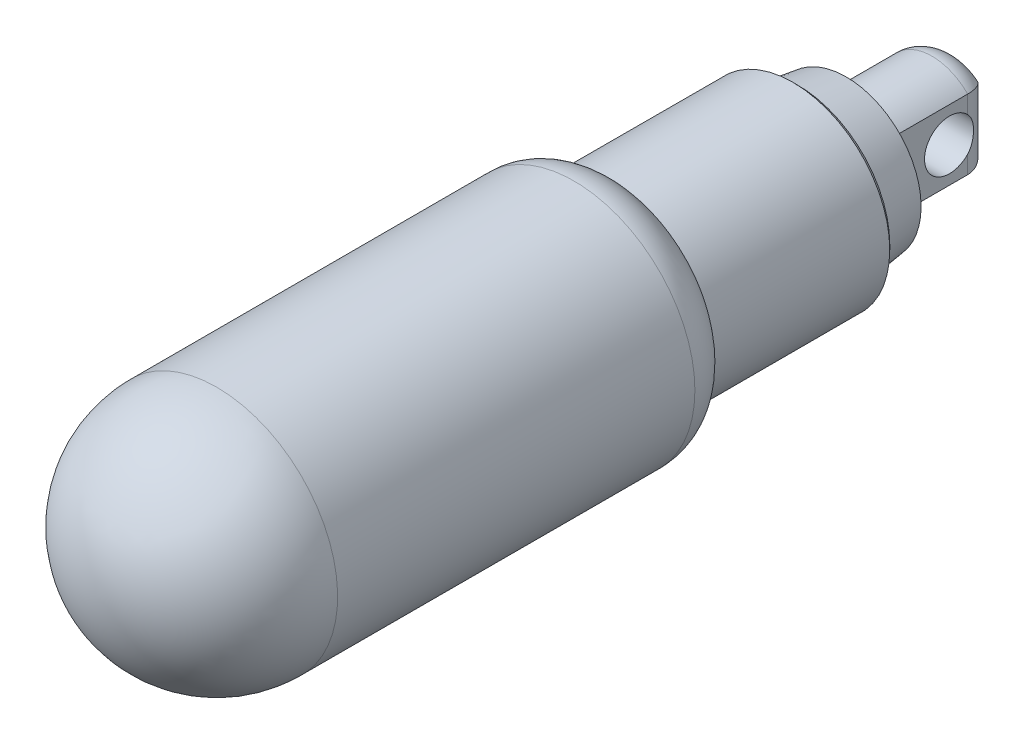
ISO-10303-21;
HEADER;
FILE_DESCRIPTION(('STEP AP214'),'2;1');
FILE_NAME('part.step','',(''),(''),'','','');
FILE_SCHEMA(('AUTOMOTIVE_DESIGN { 1 0 10303 214 1 1 1 1 }'));
ENDSEC;
DATA;
#1=APPLICATION_CONTEXT('core data for automotive mechanical design processes');
#2=APPLICATION_PROTOCOL_DEFINITION('international standard','automotive_design',2000,#1);
#3=PRODUCT_CONTEXT('',#1,'mechanical');
#4=PRODUCT('Part','Part','',(#3));
#5=PRODUCT_RELATED_PRODUCT_CATEGORY('part','',(#4));
#6=PRODUCT_DEFINITION_FORMATION('','',#4);
#7=PRODUCT_DEFINITION_CONTEXT('part definition',#1,'design');
#8=PRODUCT_DEFINITION('design','',#6,#7);
#9=PRODUCT_DEFINITION_SHAPE('','',#8);
#10=(LENGTH_UNIT() NAMED_UNIT(*) SI_UNIT(.MILLI.,.METRE.));
#11=(NAMED_UNIT(*) PLANE_ANGLE_UNIT() SI_UNIT($,.RADIAN.));
#12=(NAMED_UNIT(*) SI_UNIT($,.STERADIAN.) SOLID_ANGLE_UNIT());
#13=UNCERTAINTY_MEASURE_WITH_UNIT(LENGTH_MEASURE(1.E-05),#10,'distance_accuracy_value','');
#14=(GEOMETRIC_REPRESENTATION_CONTEXT(3) GLOBAL_UNCERTAINTY_ASSIGNED_CONTEXT((#13)) GLOBAL_UNIT_ASSIGNED_CONTEXT((#10,
#11,#12)) REPRESENTATION_CONTEXT('',''));
#15=CARTESIAN_POINT('',(0.,0.,0.));
#16=DIRECTION('',(0.,0.,1.));
#17=DIRECTION('',(1.,0.,0.));
#18=AXIS2_PLACEMENT_3D('',#15,#16,#17);
#19=CARTESIAN_POINT('',(0.,-0.8,-2.76756756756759));
#20=DIRECTION('',(0.,0.,-1.));
#21=DIRECTION('',(0.,1.,0.));
#22=AXIS2_PLACEMENT_3D('',#19,#20,#21);
#23=PLANE('',#22);
#24=DIRECTION('',(0.,1.,0.));
#25=VECTOR('',#24,1.);
#26=CARTESIAN_POINT('',(-0.685714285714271,7.75,-2.76756756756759));
#27=LINE('',#26,#25);
#28=CARTESIAN_POINT('',(-0.685714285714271,1.4456126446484,-2.76756756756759));
#29=VERTEX_POINT('',#28);
#30=CARTESIAN_POINT('',(-0.685714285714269,-1.4456126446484,-2.76756756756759));
#31=VERTEX_POINT('',#30);
#32=EDGE_CURVE('E208',#29,#31,#27,.F.);
#33=ORIENTED_EDGE('',*,*,#32,.F.);
#34=CARTESIAN_POINT('',(0.,0.,-2.76756756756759));
#35=DIRECTION('',(0.,0.,1.));
#36=DIRECTION('',(0.428571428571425,0.903507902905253,0.));
#37=AXIS2_PLACEMENT_3D('',#34,#35,#36);
#38=CIRCLE('',#37,1.59999999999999);
#39=CARTESIAN_POINT('',(0.685714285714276,1.4456126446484,-2.76756756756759));
#40=VERTEX_POINT('',#39);
#41=EDGE_CURVE('E73',#29,#40,#38,.F.);
#42=ORIENTED_EDGE('',*,*,#41,.T.);
#43=DIRECTION('',(0.,1.,0.));
#44=VECTOR('',#43,1.);
#45=CARTESIAN_POINT('',(0.685714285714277,7.75,-2.76756756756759));
#46=LINE('',#45,#44);
#47=CARTESIAN_POINT('',(0.685714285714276,-1.4456126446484,-2.76756756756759));
#48=VERTEX_POINT('',#47);
#49=EDGE_CURVE('E89',#48,#40,#46,.T.);
#50=ORIENTED_EDGE('',*,*,#49,.F.);
#51=CARTESIAN_POINT('',(0.,0.,-2.76756756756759));
#52=DIRECTION('',(0.,0.,1.));
#53=DIRECTION('',(-0.42857142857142,-0.903507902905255,0.));
#54=AXIS2_PLACEMENT_3D('',#51,#52,#53);
#55=CIRCLE('',#54,1.59999999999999);
#56=EDGE_CURVE('E112',#48,#31,#55,.F.);
#57=ORIENTED_EDGE('',*,*,#56,.T.);
#58=EDGE_LOOP('',(#33,#42,#50,#57));
#59=FACE_BOUND('',#58,.T.);
#60=ADVANCED_FACE('F14',(#59),#23,.T.);
#61=CARTESIAN_POINT('',(0.685714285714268,7.75,-1.16756756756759));
#62=DIRECTION('',(0.,1.,0.));
#63=DIRECTION('',(-1.,0.,0.));
#64=AXIS2_PLACEMENT_3D('',#61,#62,#63);
#65=CYLINDRICAL_SURFACE('',#64,1.6);
#66=CARTESIAN_POINT('',(2.28571428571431,2.23953347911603,-1.16756756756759));
#67=CARTESIAN_POINT('',(2.28571424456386,2.23953381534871,-1.18632355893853));
#68=CARTESIAN_POINT('',(2.28538571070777,2.23939759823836,-1.2050795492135));
#69=CARTESIAN_POINT('',(2.28407397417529,2.23885472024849,-1.24250660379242));
#70=CARTESIAN_POINT('',(2.28309279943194,2.23844889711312,-1.26117775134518));
#71=CARTESIAN_POINT('',(2.28048188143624,2.23737101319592,-1.29841244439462));
#72=CARTESIAN_POINT('',(2.27885402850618,2.23669972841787,-1.31697614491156));
#73=CARTESIAN_POINT('',(2.27495735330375,2.23509482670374,-1.35397378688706));
#74=CARTESIAN_POINT('',(2.27269028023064,2.23416192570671,-1.37240794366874));
#75=CARTESIAN_POINT('',(2.267523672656,2.23203740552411,-1.40912488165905));
#76=CARTESIAN_POINT('',(2.26462574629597,2.2308464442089,-1.42740792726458));
#77=CARTESIAN_POINT('',(2.2582069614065,2.22820912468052,-1.46380158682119));
#78=CARTESIAN_POINT('',(2.25468757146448,2.22676336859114,-1.48191250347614));
#79=CARTESIAN_POINT('',(2.24703633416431,2.22361949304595,-1.51794142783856));
#80=CARTESIAN_POINT('',(2.24290581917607,2.22192192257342,-1.53585976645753));
#81=CARTESIAN_POINT('',(2.23404372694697,2.21827716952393,-1.57148365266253));
#82=CARTESIAN_POINT('',(2.2293133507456,2.2163304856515,-1.58918955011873));
#83=CARTESIAN_POINT('',(2.21926380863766,2.21218998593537,-1.62436928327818));
#84=CARTESIAN_POINT('',(2.21394571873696,2.20999662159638,-1.64184347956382));
#85=CARTESIAN_POINT('',(2.20273387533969,2.2053649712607,-1.67654116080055));
#86=CARTESIAN_POINT('',(2.19684108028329,2.20292709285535,-1.69376500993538));
#87=CARTESIAN_POINT('',(2.18449372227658,2.19780840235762,-1.72794399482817));
#88=CARTESIAN_POINT('',(2.17804000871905,2.19512795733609,-1.74489949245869));
#89=CARTESIAN_POINT('',(2.16458561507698,2.18952578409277,-1.77852437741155));
#90=CARTESIAN_POINT('',(2.15758568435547,2.18660438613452,-1.79519411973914));
#91=CARTESIAN_POINT('',(2.14270648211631,2.18037671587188,-1.82902068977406));
#92=CARTESIAN_POINT('',(2.13480144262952,2.17705885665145,-1.84616405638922));
#93=CARTESIAN_POINT('',(2.11846584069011,2.17018359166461,-1.88000952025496));
#94=CARTESIAN_POINT('',(2.11003897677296,2.16662786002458,-1.89671374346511));
#95=CARTESIAN_POINT('',(2.09268509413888,2.15928543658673,-1.92966832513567));
#96=CARTESIAN_POINT('',(2.08376158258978,2.15550035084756,-1.94592088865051));
#97=CARTESIAN_POINT('',(2.06543992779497,2.14770759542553,-1.97796084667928));
#98=CARTESIAN_POINT('',(2.05604510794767,2.14370146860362,-1.99375051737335));
#99=CARTESIAN_POINT('',(2.03680653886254,2.13547464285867,-2.02485476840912));
#100=CARTESIAN_POINT('',(2.02696593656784,2.13125542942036,-2.04017168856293));
#101=CARTESIAN_POINT('',(2.00686158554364,2.12261013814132,-2.07032182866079));
#102=CARTESIAN_POINT('',(1.99660081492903,2.11818549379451,-2.08515744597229));
#103=CARTESIAN_POINT('',(1.97568192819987,2.10913675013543,-2.11433765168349));
#104=CARTESIAN_POINT('',(1.96502662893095,2.10451403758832,-2.12868468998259));
#105=CARTESIAN_POINT('',(1.94334444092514,2.09507628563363,-2.15688164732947));
#106=CARTESIAN_POINT('',(1.93232021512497,2.09026259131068,-2.17073406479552));
#107=CARTESIAN_POINT('',(1.90992580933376,2.08044975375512,-2.19793688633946));
#108=CARTESIAN_POINT('',(1.89855814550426,2.07545191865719,-2.21128983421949));
#109=CARTESIAN_POINT('',(1.87550237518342,2.06527739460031,-2.23748997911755));
#110=CARTESIAN_POINT('',(1.86381664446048,2.06010198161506,-2.25033976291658));
#111=CARTESIAN_POINT('',(1.8401498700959,2.04957882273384,-2.27553094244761));
#112=CARTESIAN_POINT('',(1.82817106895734,2.04423232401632,-2.28787496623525));
#113=CARTESIAN_POINT('',(1.80394360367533,2.03337275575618,-2.31205309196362));
#114=CARTESIAN_POINT('',(1.79169705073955,2.02786091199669,-2.32388986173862));
#115=CARTESIAN_POINT('',(1.76469227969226,2.01565460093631,-2.34917320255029));
#116=CARTESIAN_POINT('',(1.74987194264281,2.00892297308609,-2.36253561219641));
#117=CARTESIAN_POINT('',(1.71995518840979,1.99526534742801,-2.38851455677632));
#118=CARTESIAN_POINT('',(1.70486277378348,1.98834182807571,-2.40113700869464));
#119=CARTESIAN_POINT('',(1.67444277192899,1.97431256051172,-2.42564294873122));
#120=CARTESIAN_POINT('',(1.65911888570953,1.96720923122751,-2.43753241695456));
#121=CARTESIAN_POINT('',(1.62827524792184,1.95283288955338,-2.46058072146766));
#122=CARTESIAN_POINT('',(1.61275890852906,1.94556223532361,-2.47174559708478));
#123=CARTESIAN_POINT('',(1.58156838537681,1.93086318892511,-2.49335484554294));
#124=CARTESIAN_POINT('',(1.56589733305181,1.92343710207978,-2.50380530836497));
#125=CARTESIAN_POINT('',(1.53443395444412,1.90843883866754,-2.52399738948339));
#126=CARTESIAN_POINT('',(1.51864448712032,1.90086891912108,-2.53374514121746));
#127=CARTESIAN_POINT('',(1.48697937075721,1.88559429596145,-2.5525448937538));
#128=CARTESIAN_POINT('',(1.47110631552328,1.87789180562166,-2.56160306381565));
#129=CARTESIAN_POINT('',(1.43930759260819,1.86236305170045,-2.57903804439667));
#130=CARTESIAN_POINT('',(1.42338426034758,1.85453896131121,-2.58742105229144));
#131=CARTESIAN_POINT('',(1.39151697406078,1.83877772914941,-2.60352128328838));
#132=CARTESIAN_POINT('',(1.37557510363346,1.83084272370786,-2.61124472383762));
#133=CARTESIAN_POINT('',(1.34370120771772,1.81487016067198,-2.62604243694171));
#134=CARTESIAN_POINT('',(1.32777101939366,1.80683470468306,-2.63312293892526));
#135=CARTESIAN_POINT('',(1.29594910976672,1.79067137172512,-2.64665239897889));
#136=CARTESIAN_POINT('',(1.28005898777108,1.78254556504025,-2.65310758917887));
#137=CARTESIAN_POINT('',(1.24834508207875,1.76621190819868,-2.66540465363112));
#138=CARTESIAN_POINT('',(1.23252265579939,1.75800609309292,-2.67125275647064));
#139=CARTESIAN_POINT('',(1.1854768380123,1.73342837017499,-2.68780568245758));
#140=CARTESIAN_POINT('',(1.1541127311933,1.71681104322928,-2.69775687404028));
#141=CARTESIAN_POINT('',(1.09193476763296,1.68335564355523,-2.71541734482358));
#142=CARTESIAN_POINT('',(1.06112642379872,1.66653312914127,-2.72317587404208));
#143=CARTESIAN_POINT('',(1.00021815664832,1.63273910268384,-2.7366198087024));
#144=CARTESIAN_POINT('',(0.970120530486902,1.61578270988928,-2.74235366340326));
#145=CARTESIAN_POINT('',(0.910770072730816,1.58179162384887,-2.75192020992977));
#146=CARTESIAN_POINT('',(0.881516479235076,1.5647715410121,-2.75580026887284));
#147=CARTESIAN_POINT('',(0.823965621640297,1.53072033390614,-2.76183310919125));
#148=CARTESIAN_POINT('',(0.795664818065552,1.51370328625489,-2.76403187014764));
#149=CARTESIAN_POINT('',(0.740106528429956,1.4797227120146,-2.76687751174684));
#150=CARTESIAN_POINT('',(0.712843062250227,1.46277267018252,-2.76756863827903));
#151=CARTESIAN_POINT('',(0.685714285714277,1.4456126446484,-2.76756756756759));
#152=B_SPLINE_CURVE_WITH_KNOTS('',3,(#66,#67,#68,#69,#70,#71,#72,#73,#74,#75,#76,#77,#78,#79,
#80,#81,#82,#83,#84,#85,#86,#87,#88,#89,#90,#91,#92,#93,#94,#95,#96,#97,#98,#99,#100,#101,#102,
#103,#104,#105,#106,#107,#108,#109,#110,#111,#112,#113,#114,#115,#116,#117,#118,#119,#120,#121,
#122,#123,#124,#125,#126,#127,#128,#129,#130,#131,#132,#133,#134,#135,#136,#137,#138,#139,#140,
#141,#142,#143,#144,#145,#146,#147,#148,#149,#150,#151),.UNSPECIFIED.,.F.,.F.,(4,2,2,2,2,2,2,2,
2,2,2,2,2,2,2,2,2,2,2,2,2,2,2,2,2,2,2,2,2,2,2,2,2,2,2,2,2,2,2,2,2,2,4),(0.,0.0562646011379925,
0.112355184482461,0.168283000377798,0.224059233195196,0.279694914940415,0.335200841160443,
0.390587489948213,0.445864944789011,0.501042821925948,0.556130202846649,0.611135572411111,
0.666066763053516,0.723555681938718,0.780675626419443,0.837433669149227,0.893836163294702,
0.949888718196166,1.00559618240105,1.06096263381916,1.11599137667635,1.17068494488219,
1.22504511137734,1.27907290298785,1.33276862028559,1.395932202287,1.45849095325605,
1.5204429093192,1.58178511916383,1.6425137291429,1.70262407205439,1.76211075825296,
1.82096776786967,1.87918854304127,1.93676607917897,1.99369301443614,2.0499617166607,
2.16048126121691,2.268274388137,2.37327826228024,2.47543279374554,2.57468244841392,
2.67097778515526),.UNSPECIFIED.);
#153=CARTESIAN_POINT('',(2.28571428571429,2.239533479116,-1.16756756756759));
#154=VERTEX_POINT('',#153);
#155=EDGE_CURVE('E85',#154,#40,#152,.T.);
#156=ORIENTED_EDGE('',*,*,#155,.F.);
#157=DIRECTION('',(0.,1.,0.));
#158=VECTOR('',#157,1.);
#159=CARTESIAN_POINT('',(2.28571428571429,7.75,-1.16756756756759));
#160=LINE('',#159,#158);
#161=CARTESIAN_POINT('',(2.28571428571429,1.09397713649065,-1.16756756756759));
#162=VERTEX_POINT('',#161);
#163=EDGE_CURVE('E77',#154,#162,#160,.F.);
#164=ORIENTED_EDGE('',*,*,#163,.T.);
#165=CARTESIAN_POINT('',(2.28571428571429,1.09397713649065,-1.16756756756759));
#166=CARTESIAN_POINT('',(2.28571214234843,1.06144818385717,-1.19804724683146));
#167=CARTESIAN_POINT('',(2.28484388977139,1.0276707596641,-1.22714057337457));
#168=CARTESIAN_POINT('',(2.28182986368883,0.957860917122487,-1.28237411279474));
#169=CARTESIAN_POINT('',(2.27968474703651,0.921829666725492,-1.30851583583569));
#170=CARTESIAN_POINT('',(2.2720074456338,0.810574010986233,-1.38234894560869));
#171=CARTESIAN_POINT('',(2.26523555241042,0.7322690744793,-1.42537223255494));
#172=CARTESIAN_POINT('',(2.25170361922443,0.569724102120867,-1.49777910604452));
#173=CARTESIAN_POINT('',(2.24494357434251,0.48548811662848,-1.52717189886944));
#174=CARTESIAN_POINT('',(2.23405290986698,0.31332222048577,-1.57152174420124));
#175=CARTESIAN_POINT('',(2.22991370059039,0.225405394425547,-1.5865260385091));
#176=CARTESIAN_POINT('',(2.22726284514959,0.114169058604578,-1.5960860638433));
#177=CARTESIAN_POINT('',(2.22685478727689,0.0913655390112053,-1.59755260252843));
#178=CARTESIAN_POINT('',(2.2263071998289,0.0457109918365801,-1.5995101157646));
#179=CARTESIAN_POINT('',(2.22616770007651,0.0228599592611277,-1.60000098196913));
#180=CARTESIAN_POINT('',(2.22617638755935,-0.0890054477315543,-1.59999617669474));
#181=CARTESIAN_POINT('',(2.22832494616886,-0.178146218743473,-1.59253622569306));
#182=CARTESIAN_POINT('',(2.23617435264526,-0.353969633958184,-1.56291190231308));
#183=CARTESIAN_POINT('',(2.24188580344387,-0.440644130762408,-1.54070362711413));
#184=CARTESIAN_POINT('',(2.25473970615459,-0.608894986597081,-1.48228622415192));
#185=CARTESIAN_POINT('',(2.26188042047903,-0.690477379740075,-1.44609404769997));
#186=CARTESIAN_POINT('',(2.27460137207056,-0.846418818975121,-1.3606746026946));
#187=CARTESIAN_POINT('',(2.28018596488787,-0.920797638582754,-1.31148448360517));
#188=CARTESIAN_POINT('',(2.28480622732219,-1.0263073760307,-1.22832421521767));
#189=CARTESIAN_POINT('',(2.28570850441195,-1.06081240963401,-1.19866114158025));
#190=CARTESIAN_POINT('',(2.28571428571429,-1.0939771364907,-1.16756756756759));
#191=B_SPLINE_CURVE_WITH_KNOTS('',3,(#165,#166,#167,#168,#169,#170,#171,#172,#173,#174,#175,
#176,#177,#178,#179,#180,#181,#182,#183,#184,#185,#186,#187,#188,#189,#190),.UNSPECIFIED.,.F.,
.F.,(4,2,2,2,2,2,2,2,2,2,2,2,4),(0.,0.133620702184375,0.267172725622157,0.534606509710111,
0.801859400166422,1.06823178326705,1.13678067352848,1.20533717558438,1.47226250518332,
1.73998600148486,2.00738597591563,2.27402980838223,2.41038823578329),.UNSPECIFIED.);
#192=CARTESIAN_POINT('',(2.28571428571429,-1.09397713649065,-1.16756756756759));
#193=VERTEX_POINT('',#192);
#194=EDGE_CURVE('E18',#162,#193,#191,.T.);
#195=ORIENTED_EDGE('',*,*,#194,.T.);
#196=DIRECTION('',(0.,1.,0.));
#197=VECTOR('',#196,1.);
#198=CARTESIAN_POINT('',(2.28571428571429,7.75,-1.16756756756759));
#199=LINE('',#198,#197);
#200=CARTESIAN_POINT('',(2.28571428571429,-2.239533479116,-1.16756756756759));
#201=VERTEX_POINT('',#200);
#202=EDGE_CURVE('E63',#193,#201,#199,.F.);
#203=ORIENTED_EDGE('',*,*,#202,.T.);
#204=CARTESIAN_POINT('',(0.685714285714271,-1.4456126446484,-2.76756756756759));
#205=CARTESIAN_POINT('',(0.712841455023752,-1.46277165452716,-2.76756863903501));
#206=CARTESIAN_POINT('',(0.740103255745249,-1.47972077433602,-2.76687759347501));
#207=CARTESIAN_POINT('',(0.795658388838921,-1.51369982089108,-2.76403226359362));
#208=CARTESIAN_POINT('',(0.823957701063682,-1.53071626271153,-2.76183372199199));
#209=CARTESIAN_POINT('',(0.881505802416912,-1.56476654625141,-2.75580143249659));
#210=CARTESIAN_POINT('',(0.910758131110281,-1.58178630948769,-2.75192169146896));
#211=CARTESIAN_POINT('',(0.970106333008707,-1.61577700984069,-2.74235585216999));
#212=CARTESIAN_POINT('',(1.00020296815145,-1.63273333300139,-2.7366223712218));
#213=CARTESIAN_POINT('',(1.061109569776,-1.66652743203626,-2.72317921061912));
#214=CARTESIAN_POINT('',(1.09191723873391,-1.68335008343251,-2.71542106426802));
#215=CARTESIAN_POINT('',(1.15409420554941,-1.7168059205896,-2.69776133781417));
#216=CARTESIAN_POINT('',(1.1854579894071,-1.73342354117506,-2.68781048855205));
#217=CARTESIAN_POINT('',(1.23250349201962,-1.75800172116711,-2.67125806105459));
#218=CARTESIAN_POINT('',(1.24832589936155,-1.76620772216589,-2.66541009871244));
#219=CARTESIAN_POINT('',(1.28003986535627,-1.78254176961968,-2.65311328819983));
#220=CARTESIAN_POINT('',(1.29593006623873,-1.79066777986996,-2.64665820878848));
#221=CARTESIAN_POINT('',(1.32775223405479,-1.8068315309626,-2.63312893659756));
#222=CARTESIAN_POINT('',(1.34368260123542,-1.81486720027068,-2.62604850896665));
#223=CARTESIAN_POINT('',(1.3755569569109,-1.83084019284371,-2.61125090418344));
#224=CARTESIAN_POINT('',(1.39149910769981,-1.8387754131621,-2.60352749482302));
#225=CARTESIAN_POINT('',(1.42336705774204,-1.85453706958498,-2.5874272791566));
#226=CARTESIAN_POINT('',(1.43929077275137,-1.86236136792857,-2.579044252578));
#227=CARTESIAN_POINT('',(1.47109036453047,-1.8778905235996,-2.56160918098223));
#228=CARTESIAN_POINT('',(1.48696390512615,-1.88559320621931,-2.55255093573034));
#229=CARTESIAN_POINT('',(1.5186300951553,-1.9008681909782,-2.53375097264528));
#230=CARTESIAN_POINT('',(1.53442014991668,-1.908438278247,-2.52400308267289));
#231=CARTESIAN_POINT('',(1.56588480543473,-1.92343684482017,-2.50381065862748));
#232=CARTESIAN_POINT('',(1.58155654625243,-1.93086306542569,-2.49335998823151));
#233=CARTESIAN_POINT('',(1.61274854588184,-1.94556233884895,-2.47175025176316));
#234=CARTESIAN_POINT('',(1.62826567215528,-1.95283308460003,-2.46058509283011));
#235=CARTESIAN_POINT('',(1.65911098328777,-1.9672095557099,-2.43753614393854));
#236=CARTESIAN_POINT('',(1.67443575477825,-1.97431292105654,-2.4256463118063));
#237=CARTESIAN_POINT('',(1.70485761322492,-1.98834221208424,-2.40113955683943));
#238=CARTESIAN_POINT('',(1.71995099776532,-1.99526571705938,-2.38851665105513));
#239=CARTESIAN_POINT('',(1.74986981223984,-2.00892320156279,-2.36253672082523));
#240=CARTESIAN_POINT('',(1.76469123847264,-2.01565470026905,-2.3491737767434));
#241=CARTESIAN_POINT('',(1.79169379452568,-2.02785895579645,-2.32389325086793));
#242=CARTESIAN_POINT('',(1.8039371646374,-2.03336892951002,-2.31205998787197));
#243=CARTESIAN_POINT('',(1.82815893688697,-2.0442253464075,-2.2878884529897));
#244=CARTESIAN_POINT('',(1.84013521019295,-2.04957055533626,-2.27554749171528));
#245=CARTESIAN_POINT('',(1.86379761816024,-2.06009161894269,-2.25036195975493));
#246=CARTESIAN_POINT('',(1.87548149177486,-2.06526621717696,-2.23751473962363));
#247=CARTESIAN_POINT('',(1.89853420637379,-2.07543954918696,-2.21131917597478));
#248=CARTESIAN_POINT('',(1.90990065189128,-2.08043699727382,-2.19796822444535));
#249=CARTESIAN_POINT('',(1.93229325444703,-2.09024943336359,-2.17076878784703));
#250=CARTESIAN_POINT('',(1.94331687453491,-2.09506310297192,-2.15691773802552));
#251=CARTESIAN_POINT('',(1.96499845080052,-2.10450111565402,-2.12872284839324));
#252=CARTESIAN_POINT('',(1.97565372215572,-2.10912410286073,-2.11437648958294));
#253=CARTESIAN_POINT('',(1.99657311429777,-2.11817364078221,-2.08519691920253));
#254=CARTESIAN_POINT('',(2.00683439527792,-2.1225987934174,-2.07036123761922));
#255=CARTESIAN_POINT('',(2.02694028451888,-2.13124527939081,-2.04021019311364));
#256=CARTESIAN_POINT('',(2.03678189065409,-2.13546516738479,-2.02489241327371));
#257=CARTESIAN_POINT('',(2.05602293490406,-2.14369345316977,-1.9937856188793));
#258=CARTESIAN_POINT('',(2.06541920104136,-2.14770035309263,-1.97799424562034));
#259=CARTESIAN_POINT('',(2.08374416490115,-2.15549469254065,-1.94595001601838));
#260=CARTESIAN_POINT('',(2.09266951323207,-2.15928057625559,-1.92969486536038));
#261=CARTESIAN_POINT('',(2.11002741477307,-2.16662457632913,-1.89673420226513));
#262=CARTESIAN_POINT('',(2.11845643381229,-2.17018107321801,-1.88002646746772));
#263=CARTESIAN_POINT('',(2.13479667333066,-2.17705772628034,-1.84617305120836));
#264=CARTESIAN_POINT('',(2.14270416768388,-2.18037619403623,-1.82902522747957));
#265=CARTESIAN_POINT('',(2.15758492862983,-2.18660364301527,-1.79519652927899));
#266=CARTESIAN_POINT('',(2.16458419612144,-2.18952431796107,-1.77852923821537));
#267=CARTESIAN_POINT('',(2.17803747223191,-2.19512532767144,-1.7449088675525));
#268=CARTESIAN_POINT('',(2.18449071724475,-2.19780532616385,-1.72795542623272));
#269=CARTESIAN_POINT('',(2.19683736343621,-2.20292332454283,-1.69378015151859));
#270=CARTESIAN_POINT('',(2.20272990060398,-2.20536095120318,-1.67655795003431));
#271=CARTESIAN_POINT('',(2.21394141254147,-2.20999227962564,-1.64186313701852));
#272=CARTESIAN_POINT('',(2.21925941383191,-2.21218556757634,-1.62439015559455));
#273=CARTESIAN_POINT('',(2.22930893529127,-2.21632605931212,-1.58921240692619));
#274=CARTESIAN_POINT('',(2.23403936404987,-2.21827280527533,-1.57150727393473));
#275=CARTESIAN_POINT('',(2.24290168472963,-2.22191779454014,-1.53588445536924));
#276=CARTESIAN_POINT('',(2.24703235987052,-2.22361553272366,-1.51796641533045));
#277=CARTESIAN_POINT('',(2.25468400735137,-2.22675982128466,-1.4819376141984));
#278=CARTESIAN_POINT('',(2.25820363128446,-2.22820581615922,-1.46382651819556));
#279=CARTESIAN_POINT('',(2.26462293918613,-2.23084365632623,-1.42743201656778));
#280=CARTESIAN_POINT('',(2.26752113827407,-2.23203489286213,-1.40914830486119));
#281=CARTESIAN_POINT('',(2.27268831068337,-2.23415997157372,-1.372429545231));
#282=CARTESIAN_POINT('',(2.27495565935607,-2.23509314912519,-1.35399423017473));
#283=CARTESIAN_POINT('',(2.27885286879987,-2.23669857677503,-1.31699377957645));
#284=CARTESIAN_POINT('',(2.28048096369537,-2.23737010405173,-1.29842842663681));
#285=CARTESIAN_POINT('',(2.28309231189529,-2.23844841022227,-1.26118993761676));
#286=CARTESIAN_POINT('',(2.28407365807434,-2.23885440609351,-1.24251664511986));
#287=CARTESIAN_POINT('',(2.28538564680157,-2.23939753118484,-1.20508481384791));
#288=CARTESIAN_POINT('',(2.28571424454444,-2.23953381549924,-1.18632619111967));
#289=CARTESIAN_POINT('',(2.2857142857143,-2.23953347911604,-1.16756756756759));
#290=B_SPLINE_CURVE_WITH_KNOTS('',3,(#204,#205,#206,#207,#208,#209,#210,#211,#212,#213,#214,
#215,#216,#217,#218,#219,#220,#221,#222,#223,#224,#225,#226,#227,#228,#229,#230,#231,#232,#233,
#234,#235,#236,#237,#238,#239,#240,#241,#242,#243,#244,#245,#246,#247,#248,#249,#250,#251,#252,
#253,#254,#255,#256,#257,#258,#259,#260,#261,#262,#263,#264,#265,#266,#267,#268,#269,#270,#271,
#272,#273,#274,#275,#276,#277,#278,#279,#280,#281,#282,#283,#284,#285,#286,#287,#288,#289),
.UNSPECIFIED.,.F.,.F.,(4,2,2,2,2,2,2,2,2,2,2,2,2,2,2,2,2,2,2,2,2,2,2,2,2,2,2,2,2,2,2,2,2,2,2,2,
2,2,2,2,2,2,4),(0.,0.0962896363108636,0.195534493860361,0.297685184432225,0.402686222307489,
0.510477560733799,0.620996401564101,0.677265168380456,0.734192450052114,0.791770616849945,
0.849992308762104,0.908850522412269,0.968338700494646,1.02845082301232,1.08918149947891,
1.15052606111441,1.21248065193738,1.27504231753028,1.33820909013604,1.39188959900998,
1.44590490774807,1.50025533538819,1.55494192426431,1.60996645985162,1.66533148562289,
1.72104031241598,1.77709702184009,1.83350646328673,1.89027424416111,1.94740671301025,
2.00491093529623,2.05983433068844,2.11483330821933,2.16991570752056,2.22509001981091,
2.28036533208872,2.33575126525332,2.39125790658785,2.44689573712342,2.50267555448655,
2.55860839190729,2.61470543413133,2.67097793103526),.UNSPECIFIED.);
#291=EDGE_CURVE('E220',#48,#201,#290,.T.);
#292=ORIENTED_EDGE('',*,*,#291,.F.);
#293=ORIENTED_EDGE('',*,*,#49,.T.);
#294=EDGE_LOOP('',(#156,#164,#195,#203,#292,#293));
#295=FACE_BOUND('',#294,.T.);
#296=ADVANCED_FACE('F82',(#295),#65,.T.);
#297=CARTESIAN_POINT('',(-0.68571428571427,7.75,-1.16756756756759));
#298=DIRECTION('',(0.,1.,0.));
#299=DIRECTION('',(-1.,0.,0.));
#300=AXIS2_PLACEMENT_3D('',#297,#298,#299);
#301=CYLINDRICAL_SURFACE('',#300,1.6);
#302=CARTESIAN_POINT('',(-2.28571428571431,-2.23953347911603,-1.16756756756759));
#303=CARTESIAN_POINT('',(-2.28571424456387,-2.2395338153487,-1.18632355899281));
#304=CARTESIAN_POINT('',(-2.28538571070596,-2.23939759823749,-1.20507954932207));
#305=CARTESIAN_POINT('',(-2.28407397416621,-2.23885472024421,-1.24250660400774));
#306=CARTESIAN_POINT('',(-2.28309279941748,-2.23844889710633,-1.26117775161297));
#307=CARTESIAN_POINT('',(-2.28048188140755,-2.23737101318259,-1.29841244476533));
#308=CARTESIAN_POINT('',(-2.2788540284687,-2.23669972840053,-1.31697614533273));
#309=CARTESIAN_POINT('',(-2.27495735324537,-2.23509482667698,-1.35397378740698));
#310=CARTESIAN_POINT('',(-2.27269028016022,-2.23416192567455,-1.37240794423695));
#311=CARTESIAN_POINT('',(-2.26752367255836,-2.23203740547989,-1.4091248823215));
#312=CARTESIAN_POINT('',(-2.26462574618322,-2.23084644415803,-1.42740792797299));
#313=CARTESIAN_POINT('',(-2.25820696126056,-2.22820912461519,-1.46380158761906));
#314=CARTESIAN_POINT('',(-2.25468757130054,-2.22676336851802,-1.48191250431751));
#315=CARTESIAN_POINT('',(-2.24703633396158,-2.2236194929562,-1.51794142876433));
#316=CARTESIAN_POINT('',(-2.24290581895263,-2.22192192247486,-1.53585976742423));
#317=CARTESIAN_POINT('',(-2.23404372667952,-2.21827716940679,-1.57148365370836));
#318=CARTESIAN_POINT('',(-2.22931335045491,-2.21633048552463,-1.58918955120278));
#319=CARTESIAN_POINT('',(-2.21926380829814,-2.2121899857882,-1.62436928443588));
#320=CARTESIAN_POINT('',(-2.21394571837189,-2.20999662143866,-1.64184348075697));
#321=CARTESIAN_POINT('',(-2.20273387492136,-2.20536497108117,-1.67654116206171));
#322=CARTESIAN_POINT('',(-2.1968410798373,-2.20292709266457,-1.69376501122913));
#323=CARTESIAN_POINT('',(-2.1844937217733,-2.19780840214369,-1.72794399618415));
#324=CARTESIAN_POINT('',(-2.17804000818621,-2.19512795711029,-1.74489949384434));
#325=CARTESIAN_POINT('',(-2.16458561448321,-2.18952578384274,-1.77852437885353));
#326=CARTESIAN_POINT('',(-2.15758568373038,-2.18660438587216,-1.7951941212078));
#327=CARTESIAN_POINT('',(-2.14270648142,-2.18037671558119,-1.8290206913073));
#328=CARTESIAN_POINT('',(-2.13480144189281,-2.17705885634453,-1.84616405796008));
#329=CARTESIAN_POINT('',(-2.11846583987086,-2.17018359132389,-1.88000952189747));
#330=CARTESIAN_POINT('',(-2.11003897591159,-2.16662785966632,-1.89671374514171));
#331=CARTESIAN_POINT('',(-2.09268509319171,-2.15928543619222,-1.92966832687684));
#332=CARTESIAN_POINT('',(-2.08376158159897,-2.15550035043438,-1.94592089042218));
#333=CARTESIAN_POINT('',(-2.06543992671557,-2.14770759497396,-1.97796084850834));
#334=CARTESIAN_POINT('',(-2.05604510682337,-2.14370146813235,-1.99375051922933));
#335=CARTESIAN_POINT('',(-2.03680653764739,-2.13547464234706,-2.02485477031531));
#336=CARTESIAN_POINT('',(-2.02696593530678,-2.13125542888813,-2.04017169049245));
#337=CARTESIAN_POINT('',(-2.00686158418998,-2.12261013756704,-2.07032183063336));
#338=CARTESIAN_POINT('',(-1.99660081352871,-2.1181854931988,-2.08515744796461));
#339=CARTESIAN_POINT('',(-1.97568192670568,-2.10913674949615,-2.11433765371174));
#340=CARTESIAN_POINT('',(-1.96502662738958,-2.1045140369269,-2.12868469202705));
#341=CARTESIAN_POINT('',(-1.94334443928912,-2.09507628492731,-2.15688164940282));
#342=CARTESIAN_POINT('',(-1.9323202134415,-2.09026259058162,-2.17073406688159));
#343=CARTESIAN_POINT('',(-1.90992580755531,-2.08044975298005,-2.19793688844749));
#344=CARTESIAN_POINT('',(-1.8985581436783,-2.07545191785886,-2.2112898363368));
#345=CARTESIAN_POINT('',(-1.87550237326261,-2.06527739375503,-2.23748998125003));
#346=CARTESIAN_POINT('',(-1.86381664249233,-2.0601019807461,-2.25033976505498));
#347=CARTESIAN_POINT('',(-1.84014986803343,-2.0495788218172,-2.27553094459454));
#348=CARTESIAN_POINT('',(-1.82817106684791,-2.04423232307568,-2.28787496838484));
#349=CARTESIAN_POINT('',(-1.80394360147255,-2.03337275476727,-2.31205309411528));
#350=CARTESIAN_POINT('',(-1.79169704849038,-2.02786091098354,-2.32388986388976));
#351=CARTESIAN_POINT('',(-1.76469227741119,-2.01565459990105,-2.34917320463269));
#352=CARTESIAN_POINT('',(-1.74987194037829,-2.00892297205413,-2.36253561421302));
#353=CARTESIAN_POINT('',(-1.71995518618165,-1.99526534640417,-2.38851455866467));
#354=CARTESIAN_POINT('',(-1.70486277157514,-1.98834182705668,-2.4011370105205));
#355=CARTESIAN_POINT('',(-1.67444276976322,-1.97431255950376,-2.42564295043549));
#356=CARTESIAN_POINT('',(-1.6591188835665,-1.96720923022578,-2.4375324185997));
#357=CARTESIAN_POINT('',(-1.62827524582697,-1.95283288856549,-2.46058072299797));
#358=CARTESIAN_POINT('',(-1.61275890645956,-1.94556223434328,-2.47174559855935));
#359=CARTESIAN_POINT('',(-1.58156838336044,-1.93086318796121,-2.49335484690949));
#360=CARTESIAN_POINT('',(-1.56589733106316,-1.92343710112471,-2.5038053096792));
#361=CARTESIAN_POINT('',(-1.53443395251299,-1.90843883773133,-2.52399739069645));
#362=CARTESIAN_POINT('',(-1.51864448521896,-1.90086891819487,-2.53374514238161));
#363=CARTESIAN_POINT('',(-1.48697936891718,-1.88559429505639,-2.55254489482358));
#364=CARTESIAN_POINT('',(-1.4711063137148,-1.87789180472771,-2.56160306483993));
#365=CARTESIAN_POINT('',(-1.4393075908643,-1.86236305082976,-2.57903804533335));
#366=CARTESIAN_POINT('',(-1.42338425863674,-1.85453896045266,-2.58742105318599));
#367=CARTESIAN_POINT('',(-1.39151697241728,-1.83877772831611,-2.60352128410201));
#368=CARTESIAN_POINT('',(-1.37557510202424,-1.83084272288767,-2.61124472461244));
#369=CARTESIAN_POINT('',(-1.34370120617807,-1.81487015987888,-2.62604243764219));
#370=CARTESIAN_POINT('',(-1.32777101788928,-1.80683470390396,-2.63312293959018));
#371=CARTESIAN_POINT('',(-1.29594910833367,-1.79067137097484,-2.64665239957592));
#372=CARTESIAN_POINT('',(-1.28005898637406,-1.78254556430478,-2.65310758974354));
#373=CARTESIAN_POINT('',(-1.24834508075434,-1.76621190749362,-2.66540465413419));
#374=CARTESIAN_POINT('',(-1.23252265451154,-1.75800609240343,-2.67125275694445));
#375=CARTESIAN_POINT('',(-1.18547683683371,-1.73342836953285,-2.68780568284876));
#376=CARTESIAN_POINT('',(-1.15411273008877,-1.71681104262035,-2.69775687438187));
#377=CARTESIAN_POINT('',(-1.09193476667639,-1.68335564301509,-2.7154173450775));
#378=CARTESIAN_POINT('',(-1.06112642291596,-1.66653312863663,-2.72317587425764));
#379=CARTESIAN_POINT('',(-1.00021815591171,-1.63273910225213,-2.73661980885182));
#380=CARTESIAN_POINT('',(-0.970120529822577,-1.6157827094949,-2.74235366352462));
#381=CARTESIAN_POINT('',(-0.910770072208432,-1.58179162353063,-2.7519202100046));
#382=CARTESIAN_POINT('',(-0.881516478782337,-1.56477154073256,-2.75580026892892));
#383=CARTESIAN_POINT('',(-0.823965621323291,-1.53072033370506,-2.76183310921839));
#384=CARTESIAN_POINT('',(-0.795664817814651,-1.51370328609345,-2.76403187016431));
#385=CARTESIAN_POINT('',(-0.74010652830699,-1.47972271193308,-2.76687751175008));
#386=CARTESIAN_POINT('',(-0.71284306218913,-1.46277267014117,-2.76756863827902));
#387=CARTESIAN_POINT('',(-0.685714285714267,-1.4456126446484,-2.76756756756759));
#388=B_SPLINE_CURVE_WITH_KNOTS('',3,(#302,#303,#304,#305,#306,#307,#308,#309,#310,#311,#312,
#313,#314,#315,#316,#317,#318,#319,#320,#321,#322,#323,#324,#325,#326,#327,#328,#329,#330,#331,
#332,#333,#334,#335,#336,#337,#338,#339,#340,#341,#342,#343,#344,#345,#346,#347,#348,#349,#350,
#351,#352,#353,#354,#355,#356,#357,#358,#359,#360,#361,#362,#363,#364,#365,#366,#367,#368,#369,
#370,#371,#372,#373,#374,#375,#376,#377,#378,#379,#380,#381,#382,#383,#384,#385,#386,#387),
.UNSPECIFIED.,.F.,.F.,(4,2,2,2,2,2,2,2,2,2,2,2,2,2,2,2,2,2,2,2,2,2,2,2,2,2,2,2,2,2,2,2,2,2,2,2,
2,2,2,2,2,2,4),(0.,0.056264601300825,0.112355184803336,0.168283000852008,0.22405923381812,
0.279694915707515,0.335200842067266,0.390587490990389,0.445864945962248,0.501042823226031,
0.556130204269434,0.611135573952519,0.666066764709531,0.72355568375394,0.780675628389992,
0.837433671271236,0.893836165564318,0.949888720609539,1.00559618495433,1.06096263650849,
1.11599137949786,1.17068494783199,1.22504511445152,1.27907290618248,1.33276862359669,
1.39593220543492,1.45849095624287,1.52044291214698,1.5817851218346,1.64251373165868,
1.70262407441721,1.76211076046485,1.8209677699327,1.87918854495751,1.93676608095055,
1.99369301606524,2.04996171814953,2.16048126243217,2.26827438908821,2.37327826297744,
2.47543279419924,2.57468244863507,2.67097778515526),.UNSPECIFIED.);
#389=CARTESIAN_POINT('',(-2.2857142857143,-2.23953347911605,-1.16756756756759));
#390=VERTEX_POINT('',#389);
#391=EDGE_CURVE('E196',#390,#31,#388,.T.);
#392=ORIENTED_EDGE('',*,*,#391,.F.);
#393=DIRECTION('',(0.,1.,0.));
#394=VECTOR('',#393,1.);
#395=CARTESIAN_POINT('',(-2.28571428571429,7.75,-1.16756756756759));
#396=LINE('',#395,#394);
#397=CARTESIAN_POINT('',(-2.28571428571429,-1.09397713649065,-1.16756756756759));
#398=VERTEX_POINT('',#397);
#399=EDGE_CURVE('E201',#390,#398,#396,.T.);
#400=ORIENTED_EDGE('',*,*,#399,.T.);
#401=CARTESIAN_POINT('',(-2.28571428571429,-1.0939771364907,-1.16756756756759));
#402=CARTESIAN_POINT('',(-2.28571214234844,-1.0614481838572,-1.19804724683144));
#403=CARTESIAN_POINT('',(-2.2848438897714,-1.02767075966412,-1.22714057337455));
#404=CARTESIAN_POINT('',(-2.28182986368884,-0.957860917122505,-1.28237411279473));
#405=CARTESIAN_POINT('',(-2.27968474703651,-0.921829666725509,-1.30851583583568));
#406=CARTESIAN_POINT('',(-2.2720074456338,-0.810574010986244,-1.38234894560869));
#407=CARTESIAN_POINT('',(-2.26523555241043,-0.732269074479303,-1.42537223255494));
#408=CARTESIAN_POINT('',(-2.25170361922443,-0.569724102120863,-1.49777910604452));
#409=CARTESIAN_POINT('',(-2.24494357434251,-0.485488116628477,-1.52717189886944));
#410=CARTESIAN_POINT('',(-2.23405290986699,-0.313322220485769,-1.57152174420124));
#411=CARTESIAN_POINT('',(-2.2299137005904,-0.225405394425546,-1.5865260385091));
#412=CARTESIAN_POINT('',(-2.22726284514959,-0.114169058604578,-1.5960860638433));
#413=CARTESIAN_POINT('',(-2.22685478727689,-0.0913655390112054,-1.59755260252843));
#414=CARTESIAN_POINT('',(-2.2263071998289,-0.0457109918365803,-1.5995101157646));
#415=CARTESIAN_POINT('',(-2.22616770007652,-0.0228599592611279,-1.60000098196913));
#416=CARTESIAN_POINT('',(-2.22617638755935,0.0890054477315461,-1.59999617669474));
#417=CARTESIAN_POINT('',(-2.22832494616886,0.178146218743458,-1.59253622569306));
#418=CARTESIAN_POINT('',(-2.23617435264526,0.353969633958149,-1.56291190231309));
#419=CARTESIAN_POINT('',(-2.24188580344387,0.440644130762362,-1.54070362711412));
#420=CARTESIAN_POINT('',(-2.25473970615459,0.608894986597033,-1.48228622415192));
#421=CARTESIAN_POINT('',(-2.26188042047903,0.690477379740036,-1.44609404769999));
#422=CARTESIAN_POINT('',(-2.27460137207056,0.846418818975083,-1.36067460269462));
#423=CARTESIAN_POINT('',(-2.28018596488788,0.920797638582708,-1.31148448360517));
#424=CARTESIAN_POINT('',(-2.28480622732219,1.02630737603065,-1.22832421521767));
#425=CARTESIAN_POINT('',(-2.28570850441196,1.06081240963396,-1.19866114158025));
#426=CARTESIAN_POINT('',(-2.28571428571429,1.09397713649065,-1.16756756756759));
#427=B_SPLINE_CURVE_WITH_KNOTS('',3,(#401,#402,#403,#404,#405,#406,#407,#408,#409,#410,#411,
#412,#413,#414,#415,#416,#417,#418,#419,#420,#421,#422,#423,#424,#425,#426),.UNSPECIFIED.,.F.,
.F.,(4,2,2,2,2,2,2,2,2,2,2,2,4),(0.,0.133620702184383,0.267172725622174,0.53460650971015,
0.80185940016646,1.06823178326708,1.13678067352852,1.20533717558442,1.47226250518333,
1.73998600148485,2.00738597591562,2.27402980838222,2.41038823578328),.UNSPECIFIED.);
#428=CARTESIAN_POINT('',(-2.28571428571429,1.09397713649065,-1.16756756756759));
#429=VERTEX_POINT('',#428);
#430=EDGE_CURVE('E88',#398,#429,#427,.T.);
#431=ORIENTED_EDGE('',*,*,#430,.T.);
#432=DIRECTION('',(0.,1.,0.));
#433=VECTOR('',#432,1.);
#434=CARTESIAN_POINT('',(-2.28571428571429,7.75,-1.16756756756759));
#435=LINE('',#434,#433);
#436=CARTESIAN_POINT('',(-2.28571428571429,2.239533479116,-1.16756756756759));
#437=VERTEX_POINT('',#436);
#438=EDGE_CURVE('E92',#429,#437,#435,.T.);
#439=ORIENTED_EDGE('',*,*,#438,.T.);
#440=CARTESIAN_POINT('',(-0.685714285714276,1.4456126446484,-2.76756756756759));
#441=CARTESIAN_POINT('',(-0.71284145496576,1.46277165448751,-2.767568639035));
#442=CARTESIAN_POINT('',(-0.740103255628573,1.47972077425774,-2.7668775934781));
#443=CARTESIAN_POINT('',(-0.79565838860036,1.51369982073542,-2.76403226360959));
#444=CARTESIAN_POINT('',(-0.823957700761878,1.5307162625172,-2.76183372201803));
#445=CARTESIAN_POINT('',(-0.881505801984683,1.56476654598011,-2.75580143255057));
#446=CARTESIAN_POINT('',(-0.91075813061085,1.58178630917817,-2.75192169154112));
#447=CARTESIAN_POINT('',(-0.970106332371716,1.61577700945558,-2.74235585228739));
#448=CARTESIAN_POINT('',(-1.0002029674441,1.63273333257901,-2.73662237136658));
#449=CARTESIAN_POINT('',(-1.0611095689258,1.66652743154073,-2.72317921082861));
#450=CARTESIAN_POINT('',(-1.09191723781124,1.6833500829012,-2.71542106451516));
#451=CARTESIAN_POINT('',(-1.15409420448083,1.71680591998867,-2.69776133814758));
#452=CARTESIAN_POINT('',(-1.18545798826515,1.7334235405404,-2.6878104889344));
#453=CARTESIAN_POINT('',(-1.23250349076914,1.75800172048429,-2.67125806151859));
#454=CARTESIAN_POINT('',(-1.24832589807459,1.76620772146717,-2.66541009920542));
#455=CARTESIAN_POINT('',(-1.28003986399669,1.78254176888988,-2.65311328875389));
#456=CARTESIAN_POINT('',(-1.29593006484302,1.790667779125,-2.64665820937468));
#457=CARTESIAN_POINT('',(-1.32775223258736,1.80683153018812,-2.63312893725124));
#458=CARTESIAN_POINT('',(-1.34368259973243,1.81486719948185,-2.62604850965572));
#459=CARTESIAN_POINT('',(-1.37555695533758,1.83084019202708,-2.61125090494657));
#460=CARTESIAN_POINT('',(-1.39149910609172,1.83877541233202,-2.60352749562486));
#461=CARTESIAN_POINT('',(-1.42336705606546,1.85453706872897,-2.58742728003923));
#462=CARTESIAN_POINT('',(-1.43929077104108,1.8623613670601,-2.57904425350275));
#463=CARTESIAN_POINT('',(-1.47109036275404,1.87789052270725,-2.56160918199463));
#464=CARTESIAN_POINT('',(-1.48696390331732,1.88559320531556,-2.55255093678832));
#465=CARTESIAN_POINT('',(-1.5186300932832,1.9008681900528,-2.53375097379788));
#466=CARTESIAN_POINT('',(-1.53442014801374,1.90843827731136,-2.52400308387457));
#467=CARTESIAN_POINT('',(-1.56588480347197,1.92343684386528,-2.50381065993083));
#468=CARTESIAN_POINT('',(-1.5815565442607,1.93086306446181,-2.49335998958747));
#469=CARTESIAN_POINT('',(-1.61274854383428,1.94556233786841,-2.47175025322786));
#470=CARTESIAN_POINT('',(-1.6282656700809,1.95283308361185,-2.46058509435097));
#471=CARTESIAN_POINT('',(-1.65911098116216,1.96720955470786,-2.43753614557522));
#472=CARTESIAN_POINT('',(-1.67443575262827,1.9743129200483,-2.42564631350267));
#473=CARTESIAN_POINT('',(-1.70485761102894,1.98834221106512,-2.40113955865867));
#474=CARTESIAN_POINT('',(-1.71995099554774,1.99526571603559,-2.38851665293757));
#475=CARTESIAN_POINT('',(-1.74986980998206,2.00892320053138,-2.36253672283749));
#476=CARTESIAN_POINT('',(-1.76469123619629,2.0156546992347,-2.34917377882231));
#477=CARTESIAN_POINT('',(-1.79169379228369,2.02785895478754,-2.32389325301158));
#478=CARTESIAN_POINT('',(-1.80393716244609,2.03336892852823,-2.31205999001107));
#479=CARTESIAN_POINT('',(-1.82815893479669,2.04422534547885,-2.28788845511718));
#480=CARTESIAN_POINT('',(-1.84013520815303,2.04957055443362,-2.27554749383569));
#481=CARTESIAN_POINT('',(-1.86379761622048,2.06009161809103,-2.25036196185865));
#482=CARTESIAN_POINT('',(-1.87548148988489,2.06526621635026,-2.23751474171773));
#483=CARTESIAN_POINT('',(-1.89853420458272,2.07543954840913,-2.21131917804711));
#484=CARTESIAN_POINT('',(-1.90990065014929,2.08043699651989,-2.19796822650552));
#485=CARTESIAN_POINT('',(-1.93229325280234,2.09024943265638,-2.17076878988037));
#486=CARTESIAN_POINT('',(-1.94331687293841,2.09506310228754,-2.15691774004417));
#487=CARTESIAN_POINT('',(-1.96499844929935,2.1045011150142,-2.12872285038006));
#488=CARTESIAN_POINT('',(-1.97565372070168,2.10912410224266,-2.11437649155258));
#489=CARTESIAN_POINT('',(-1.99657311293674,2.11817364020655,-2.08519692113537));
#490=CARTESIAN_POINT('',(-2.00683439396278,2.1225987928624,-2.07036123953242));
#491=CARTESIAN_POINT('',(-2.02694028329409,2.13124527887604,-2.04021019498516));
#492=CARTESIAN_POINT('',(-2.03678188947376,2.13546516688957,-2.02489241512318));
#493=CARTESIAN_POINT('',(-2.05602293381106,2.14369345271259,-1.9937856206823));
#494=CARTESIAN_POINT('',(-2.06541919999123,2.14770035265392,-1.97799424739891));
#495=CARTESIAN_POINT('',(-2.08374416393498,2.15549469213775,-1.94595001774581));
#496=CARTESIAN_POINT('',(-2.092669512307,2.15928057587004,-1.92969486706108));
#497=CARTESIAN_POINT('',(-2.11002741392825,2.16662457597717,-1.89673420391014));
#498=CARTESIAN_POINT('',(-2.11845643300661,2.17018107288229,-1.88002646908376));
#499=CARTESIAN_POINT('',(-2.1347966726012,2.17705772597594,-1.84617305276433));
#500=CARTESIAN_POINT('',(-2.14270416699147,2.1803761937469,-1.82902522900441));
#501=CARTESIAN_POINT('',(-2.15758492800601,2.18660364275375,-1.7951965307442));
#502=CARTESIAN_POINT('',(-2.16458419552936,2.18952431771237,-1.77852923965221));
#503=CARTESIAN_POINT('',(-2.17803747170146,2.19512532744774,-1.74490886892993));
#504=CARTESIAN_POINT('',(-2.18449071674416,2.19780532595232,-1.72795542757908));
#505=CARTESIAN_POINT('',(-2.19683736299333,2.2029233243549,-1.69378015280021));
#506=CARTESIAN_POINT('',(-2.20272990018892,2.20536095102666,-1.67655795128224));
#507=CARTESIAN_POINT('',(-2.21394141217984,2.20999227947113,-1.64186313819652));
#508=CARTESIAN_POINT('',(-2.21925941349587,2.21218556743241,-1.6243901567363));
#509=CARTESIAN_POINT('',(-2.22930893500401,2.21632605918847,-1.58921240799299));
#510=CARTESIAN_POINT('',(-2.23403936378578,2.21827280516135,-1.57150727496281));
#511=CARTESIAN_POINT('',(-2.24290168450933,2.22191779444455,-1.53588445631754));
#512=CARTESIAN_POINT('',(-2.2470323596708,2.22361553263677,-1.51796641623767));
#513=CARTESIAN_POINT('',(-2.25468400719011,2.22675982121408,-1.48193761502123));
#514=CARTESIAN_POINT('',(-2.25820363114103,2.22820581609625,-1.46382651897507));
#515=CARTESIAN_POINT('',(-2.26462293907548,2.23084365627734,-1.42743201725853));
#516=CARTESIAN_POINT('',(-2.26752113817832,2.23203489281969,-1.40914830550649));
#517=CARTESIAN_POINT('',(-2.27268831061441,2.23415997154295,-1.37242954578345));
#518=CARTESIAN_POINT('',(-2.27495565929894,2.2350931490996,-1.35399423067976));
#519=CARTESIAN_POINT('',(-2.27885286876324,2.23669857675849,-1.31699377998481));
#520=CARTESIAN_POINT('',(-2.28048096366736,2.23737010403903,-1.29842842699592));
#521=CARTESIAN_POINT('',(-2.2830923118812,2.23844841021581,-1.26118993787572));
#522=CARTESIAN_POINT('',(-2.28407365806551,2.23885440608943,-1.24251664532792));
#523=CARTESIAN_POINT('',(-2.28538564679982,2.23939753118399,-1.20508481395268));
#524=CARTESIAN_POINT('',(-2.28571424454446,2.23953381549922,-1.18632619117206));
#525=CARTESIAN_POINT('',(-2.28571428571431,2.23953347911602,-1.16756756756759));
#526=B_SPLINE_CURVE_WITH_KNOTS('',3,(#440,#441,#442,#443,#444,#445,#446,#447,#448,#449,#450,
#451,#452,#453,#454,#455,#456,#457,#458,#459,#460,#461,#462,#463,#464,#465,#466,#467,#468,#469,
#470,#471,#472,#473,#474,#475,#476,#477,#478,#479,#480,#481,#482,#483,#484,#485,#486,#487,#488,
#489,#490,#491,#492,#493,#494,#495,#496,#497,#498,#499,#500,#501,#502,#503,#504,#505,#506,#507,
#508,#509,#510,#511,#512,#513,#514,#515,#516,#517,#518,#519,#520,#521,#522,#523,#524,#525),
.UNSPECIFIED.,.F.,.F.,(4,2,2,2,2,2,2,2,2,2,2,2,2,2,2,2,2,2,2,2,2,2,2,2,2,2,2,2,2,2,2,2,2,2,2,2,
2,2,2,2,2,2,4),(0.,0.0962896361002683,0.19553449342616,0.297685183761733,0.402686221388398,
0.510477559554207,0.620996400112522,0.677265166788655,0.734192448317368,0.791770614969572,
0.849992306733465,0.908850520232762,0.968338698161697,1.02845082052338,1.08918149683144,
1.15052605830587,1.21248064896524,1.27504231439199,1.33820908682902,1.39188959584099,
1.44590490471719,1.50025533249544,1.55494192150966,1.609966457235,1.6653314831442,
1.72104031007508,1.77709701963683,1.83350646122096,1.89027424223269,1.94740671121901,
2.00491093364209,2.05983432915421,2.11483330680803,2.1699157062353,2.22509001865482,
2.28036533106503,2.33575126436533,2.39125790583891,2.44689573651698,2.50267555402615,
2.55860839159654,2.61470543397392,2.67097793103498),.UNSPECIFIED.);
#527=EDGE_CURVE('E170',#29,#437,#526,.T.);
#528=ORIENTED_EDGE('',*,*,#527,.F.);
#529=ORIENTED_EDGE('',*,*,#32,.T.);
#530=EDGE_LOOP('',(#392,#400,#431,#439,#528,#529));
#531=FACE_BOUND('',#530,.T.);
#532=ADVANCED_FACE('F154',(#531),#301,.T.);
#533=CARTESIAN_POINT('',(1.6,0.,-1.16756756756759));
#534=DIRECTION('',(0.,1.,0.));
#535=DIRECTION('',(1.,0.,0.));
#536=AXIS2_PLACEMENT_3D('',#533,#534,#535);
#537=CIRCLE('',#536,1.6);
#538=TRIMMED_CURVE('',#537,(PARAMETER_VALUE(-3.1415926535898)),
(PARAMETER_VALUE(3.1415926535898)),.T.,.PARAMETER.);
#539=CARTESIAN_POINT('',(0.,0.,-1.16756756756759));
#540=DIRECTION('',(0.,0.,1.));
#541=AXIS1_PLACEMENT('',#539,#540);
#542=SURFACE_OF_REVOLUTION('',#538,#541);
#543=CARTESIAN_POINT('',(0.,0.,-1.16756756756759));
#544=DIRECTION('',(0.,0.,-1.));
#545=DIRECTION('',(-1.,0.,0.));
#546=AXIS2_PLACEMENT_3D('',#543,#544,#545);
#547=CIRCLE('',#546,3.2);
#548=EDGE_CURVE('E291',#154,#437,#547,.F.);
#549=ORIENTED_EDGE('',*,*,#548,.F.);
#550=ORIENTED_EDGE('',*,*,#155,.T.);
#551=ORIENTED_EDGE('',*,*,#41,.F.);
#552=ORIENTED_EDGE('',*,*,#527,.T.);
#553=EDGE_LOOP('',(#549,#550,#551,#552));
#554=FACE_BOUND('',#553,.T.);
#555=ADVANCED_FACE('F142',(#554),#542,.F.);
#556=CARTESIAN_POINT('',(1.6,0.,-1.16756756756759));
#557=DIRECTION('',(0.,1.,0.));
#558=DIRECTION('',(1.,0.,0.));
#559=AXIS2_PLACEMENT_3D('',#556,#557,#558);
#560=CIRCLE('',#559,1.6);
#561=TRIMMED_CURVE('',#560,(PARAMETER_VALUE(-3.1415926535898)),
(PARAMETER_VALUE(3.1415926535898)),.T.,.PARAMETER.);
#562=CARTESIAN_POINT('',(0.,0.,-1.16756756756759));
#563=DIRECTION('',(0.,0.,1.));
#564=AXIS1_PLACEMENT('',#562,#563);
#565=SURFACE_OF_REVOLUTION('',#561,#564);
#566=ORIENTED_EDGE('',*,*,#391,.T.);
#567=ORIENTED_EDGE('',*,*,#56,.F.);
#568=ORIENTED_EDGE('',*,*,#291,.T.);
#569=CARTESIAN_POINT('',(0.,0.,-1.16756756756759));
#570=DIRECTION('',(0.,0.,-1.));
#571=DIRECTION('',(-1.,0.,0.));
#572=AXIS2_PLACEMENT_3D('',#569,#570,#571);
#573=CIRCLE('',#572,3.2);
#574=EDGE_CURVE('E278',#390,#201,#573,.F.);
#575=ORIENTED_EDGE('',*,*,#574,.F.);
#576=EDGE_LOOP('',(#566,#567,#568,#575));
#577=FACE_BOUND('',#576,.T.);
#578=ADVANCED_FACE('F153',(#577),#565,.F.);
#579=CARTESIAN_POINT('',(-7.75,0.,0.));
#580=DIRECTION('',(-1.,0.,0.));
#581=DIRECTION('',(0.,-1.,0.));
#582=AXIS2_PLACEMENT_3D('',#579,#580,#581);
#583=CYLINDRICAL_SURFACE('',#582,1.6);
#584=ORIENTED_EDGE('',*,*,#194,.F.);
#585=CARTESIAN_POINT('',(2.28571428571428,0.,0.));
#586=DIRECTION('',(-1.,0.,0.));
#587=DIRECTION('',(0.,-1.,0.));
#588=AXIS2_PLACEMENT_3D('',#585,#586,#587);
#589=CIRCLE('',#588,1.6);
#590=EDGE_CURVE('E70',#162,#193,#589,.F.);
#591=ORIENTED_EDGE('',*,*,#590,.T.);
#592=EDGE_LOOP('',(#584,#591));
#593=FACE_BOUND('',#592,.T.);
#594=ORIENTED_EDGE('',*,*,#430,.F.);
#595=CARTESIAN_POINT('',(-2.28571428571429,0.,0.));
#596=DIRECTION('',(-1.,0.,0.));
#597=DIRECTION('',(0.,-1.,0.));
#598=AXIS2_PLACEMENT_3D('',#595,#596,#597);
#599=CIRCLE('',#598,1.6);
#600=EDGE_CURVE('E286',#398,#429,#599,.T.);
#601=ORIENTED_EDGE('',*,*,#600,.T.);
#602=EDGE_LOOP('',(#594,#601));
#603=FACE_BOUND('',#602,.T.);
#604=ADVANCED_FACE('F68',(#593,#603),#583,.F.);
#605=CARTESIAN_POINT('',(0.,0.,1.5824324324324));
#606=DIRECTION('',(0.,0.,-1.));
#607=DIRECTION('',(-1.,0.,0.));
#608=AXIS2_PLACEMENT_3D('',#605,#606,#607);
#609=CYLINDRICAL_SURFACE('',#608,3.2);
#610=DIRECTION('',(0.,0.,-1.));
#611=VECTOR('',#610,1.);
#612=CARTESIAN_POINT('',(-2.28571428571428,2.239533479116,4.3324324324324));
#613=LINE('',#612,#611);
#614=CARTESIAN_POINT('',(-2.28571428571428,2.23953347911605,4.3324324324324));
#615=VERTEX_POINT('',#614);
#616=EDGE_CURVE('E289',#437,#615,#613,.F.);
#617=ORIENTED_EDGE('',*,*,#616,.T.);
#618=CARTESIAN_POINT('',(0.,0.,4.3324324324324));
#619=DIRECTION('',(0.,0.,-1.));
#620=DIRECTION('',(-1.,0.,0.));
#621=AXIS2_PLACEMENT_3D('',#618,#619,#620);
#622=CIRCLE('',#621,3.2);
#623=CARTESIAN_POINT('',(2.28571428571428,2.23953347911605,4.3324324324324));
#624=VERTEX_POINT('',#623);
#625=EDGE_CURVE('E79',#624,#615,#622,.F.);
#626=ORIENTED_EDGE('',*,*,#625,.F.);
#627=DIRECTION('',(0.,0.,1.));
#628=VECTOR('',#627,1.);
#629=CARTESIAN_POINT('',(2.28571428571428,2.239533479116,-1.16756756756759));
#630=LINE('',#629,#628);
#631=EDGE_CURVE('E80',#624,#154,#630,.F.);
#632=ORIENTED_EDGE('',*,*,#631,.T.);
#633=ORIENTED_EDGE('',*,*,#548,.T.);
#634=EDGE_LOOP('',(#617,#626,#632,#633));
#635=FACE_BOUND('',#634,.T.);
#636=ADVANCED_FACE('F332',(#635),#609,.T.);
#637=CARTESIAN_POINT('',(-2.28571428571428,7.75,4.3324324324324));
#638=DIRECTION('',(1.,0.,0.));
#639=DIRECTION('',(0.,0.,-1.));
#640=AXIS2_PLACEMENT_3D('',#637,#638,#639);
#641=PLANE('',#640);
#642=ORIENTED_EDGE('',*,*,#600,.F.);
#643=ORIENTED_EDGE('',*,*,#399,.F.);
#644=DIRECTION('',(0.,0.,-1.));
#645=VECTOR('',#644,1.);
#646=CARTESIAN_POINT('',(-2.28571428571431,-2.23953347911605,1.5824324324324));
#647=LINE('',#646,#645);
#648=CARTESIAN_POINT('',(-2.28571428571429,-2.23953347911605,4.3324324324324));
#649=VERTEX_POINT('',#648);
#650=EDGE_CURVE('E284',#649,#390,#647,.T.);
#651=ORIENTED_EDGE('',*,*,#650,.F.);
#652=DIRECTION('',(0.,1.,0.));
#653=VECTOR('',#652,1.);
#654=CARTESIAN_POINT('',(-2.28571428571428,-4.,4.3324324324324));
#655=LINE('',#654,#653);
#656=EDGE_CURVE('E273',#615,#649,#655,.F.);
#657=ORIENTED_EDGE('',*,*,#656,.F.);
#658=ORIENTED_EDGE('',*,*,#616,.F.);
#659=ORIENTED_EDGE('',*,*,#438,.F.);
#660=EDGE_LOOP('',(#642,#643,#651,#657,#658,#659));
#661=FACE_BOUND('',#660,.T.);
#662=ADVANCED_FACE('F337',(#661),#641,.F.);
#663=CARTESIAN_POINT('',(0.,0.,1.5824324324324));
#664=DIRECTION('',(0.,0.,-1.));
#665=DIRECTION('',(-1.,0.,0.));
#666=AXIS2_PLACEMENT_3D('',#663,#664,#665);
#667=CYLINDRICAL_SURFACE('',#666,3.2);
#668=DIRECTION('',(0.,0.,1.));
#669=VECTOR('',#668,1.);
#670=CARTESIAN_POINT('',(2.28571428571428,-2.239533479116,-1.16756756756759));
#671=LINE('',#670,#669);
#672=CARTESIAN_POINT('',(2.28571428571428,-2.23953347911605,4.3324324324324));
#673=VERTEX_POINT('',#672);
#674=EDGE_CURVE('E276',#201,#673,#671,.T.);
#675=ORIENTED_EDGE('',*,*,#674,.T.);
#676=CARTESIAN_POINT('',(0.,0.,4.3324324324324));
#677=DIRECTION('',(0.,0.,-1.));
#678=DIRECTION('',(-1.,0.,0.));
#679=AXIS2_PLACEMENT_3D('',#676,#677,#678);
#680=CIRCLE('',#679,3.2);
#681=EDGE_CURVE('E272',#649,#673,#680,.F.);
#682=ORIENTED_EDGE('',*,*,#681,.F.);
#683=ORIENTED_EDGE('',*,*,#650,.T.);
#684=ORIENTED_EDGE('',*,*,#574,.T.);
#685=EDGE_LOOP('',(#675,#682,#683,#684));
#686=FACE_BOUND('',#685,.T.);
#687=ADVANCED_FACE('F393',(#686),#667,.T.);
#688=CARTESIAN_POINT('',(2.28571428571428,7.75,-1.16756756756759));
#689=DIRECTION('',(-1.,0.,0.));
#690=DIRECTION('',(0.,0.,1.));
#691=AXIS2_PLACEMENT_3D('',#688,#689,#690);
#692=PLANE('',#691);
#693=ORIENTED_EDGE('',*,*,#590,.F.);
#694=ORIENTED_EDGE('',*,*,#163,.F.);
#695=ORIENTED_EDGE('',*,*,#631,.F.);
#696=DIRECTION('',(0.,1.,0.));
#697=VECTOR('',#696,1.);
#698=CARTESIAN_POINT('',(2.28571428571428,-4.,4.3324324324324));
#699=LINE('',#698,#697);
#700=EDGE_CURVE('E268',#673,#624,#699,.T.);
#701=ORIENTED_EDGE('',*,*,#700,.F.);
#702=ORIENTED_EDGE('',*,*,#674,.F.);
#703=ORIENTED_EDGE('',*,*,#202,.F.);
#704=EDGE_LOOP('',(#693,#694,#695,#701,#702,#703));
#705=FACE_BOUND('',#704,.T.);
#706=ADVANCED_FACE('F75',(#705),#692,.F.);
#707=CARTESIAN_POINT('',(0.,-4.,4.3324324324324));
#708=DIRECTION('',(0.,0.,-1.));
#709=DIRECTION('',(0.,1.,0.));
#710=AXIS2_PLACEMENT_3D('',#707,#708,#709);
#711=PLANE('',#710);
#712=ORIENTED_EDGE('',*,*,#681,.T.);
#713=ORIENTED_EDGE('',*,*,#700,.T.);
#714=ORIENTED_EDGE('',*,*,#625,.T.);
#715=ORIENTED_EDGE('',*,*,#656,.T.);
#716=EDGE_LOOP('',(#712,#713,#714,#715));
#717=FACE_BOUND('',#716,.T.);
#718=CARTESIAN_POINT('',(0.,0.,4.33243243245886));
#719=DIRECTION('',(0.,0.,1.));
#720=DIRECTION('',(1.,0.,0.));
#721=AXIS2_PLACEMENT_3D('',#718,#719,#720);
#722=CIRCLE('',#721,4.80000000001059);
#723=CARTESIAN_POINT('',(4.80000000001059,0.,4.33243243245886));
#724=VERTEX_POINT('',#723);
#725=EDGE_CURVE('E271',#724,#724,#722,.T.);
#726=ORIENTED_EDGE('',*,*,#725,.F.);
#727=EDGE_LOOP('',(#726));
#728=FACE_BOUND('',#727,.T.);
#729=ADVANCED_FACE('F384',(#717,#728),#711,.T.);
#730=CARTESIAN_POINT('',(0.,0.,7.43243243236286));
#731=DIRECTION('',(0.,0.,1.));
#732=DIRECTION('',(1.,0.,0.));
#733=AXIS2_PLACEMENT_3D('',#730,#731,#732);
#734=CONICAL_SURFACE('',#733,5.23567658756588,0.139626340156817);
#735=CARTESIAN_POINT('',(0.,0.,7.43243243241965));
#736=DIRECTION('',(0.,0.,1.));
#737=DIRECTION('',(1.,0.,0.));
#738=AXIS2_PLACEMENT_3D('',#735,#736,#737);
#739=CIRCLE('',#738,5.23567658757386);
#740=CARTESIAN_POINT('',(5.23567658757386,0.,7.43243243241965));
#741=VERTEX_POINT('',#740);
#742=EDGE_CURVE('E356',#741,#741,#739,.T.);
#743=ORIENTED_EDGE('',*,*,#742,.F.);
#744=EDGE_LOOP('',(#743));
#745=FACE_BOUND('',#744,.T.);
#746=ORIENTED_EDGE('',*,*,#725,.T.);
#747=EDGE_LOOP('',(#746));
#748=FACE_BOUND('',#747,.T.);
#749=ADVANCED_FACE('F373',(#745,#748),#734,.T.);
#750=CARTESIAN_POINT('',(0.,-5.5628382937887,7.43243243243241));
#751=DIRECTION('',(0.,0.,-1.));
#752=DIRECTION('',(-1.,0.,0.));
#753=AXIS2_PLACEMENT_3D('',#750,#751,#752);
#754=PLANE('',#753);
#755=ORIENTED_EDGE('',*,*,#742,.T.);
#756=EDGE_LOOP('',(#755));
#757=FACE_BOUND('',#756,.T.);
#758=CARTESIAN_POINT('',(0.,0.,7.43243243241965));
#759=DIRECTION('',(0.,0.,1.));
#760=DIRECTION('',(1.,0.,0.));
#761=AXIS2_PLACEMENT_3D('',#758,#759,#760);
#762=CIRCLE('',#761,5.89000000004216);
#763=CARTESIAN_POINT('',(5.89000000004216,0.,7.43243243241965));
#764=VERTEX_POINT('',#763);
#765=EDGE_CURVE('E267',#764,#764,#762,.T.);
#766=ORIENTED_EDGE('',*,*,#765,.F.);
#767=EDGE_LOOP('',(#766));
#768=FACE_BOUND('',#767,.T.);
#769=ADVANCED_FACE('F371',(#757,#768),#754,.T.);
#770=CARTESIAN_POINT('',(0.,0.,7.74243243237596));
#771=DIRECTION('',(0.,0.,1.));
#772=DIRECTION('',(1.,0.,0.));
#773=AXIS2_PLACEMENT_3D('',#770,#771,#772);
#774=CONICAL_SURFACE('',#773,6.19999999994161,0.785398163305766);
#775=CARTESIAN_POINT('',(0.,0.,7.7424324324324));
#776=DIRECTION('',(0.,0.,-1.));
#777=DIRECTION('',(-1.,0.,0.));
#778=AXIS2_PLACEMENT_3D('',#775,#776,#777);
#779=CIRCLE('',#778,6.2);
#780=CARTESIAN_POINT('',(-6.2,0.,7.7424324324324));
#781=VERTEX_POINT('',#780);
#782=EDGE_CURVE('E264',#781,#781,#779,.F.);
#783=ORIENTED_EDGE('',*,*,#782,.F.);
#784=EDGE_LOOP('',(#783));
#785=FACE_BOUND('',#784,.T.);
#786=ORIENTED_EDGE('',*,*,#765,.T.);
#787=EDGE_LOOP('',(#786));
#788=FACE_BOUND('',#787,.T.);
#789=ADVANCED_FACE('F369',(#785,#788),#774,.T.);
#790=CARTESIAN_POINT('',(0.,0.,13.4200930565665));
#791=DIRECTION('',(0.,0.,-1.));
#792=DIRECTION('',(-1.,0.,0.));
#793=AXIS2_PLACEMENT_3D('',#790,#791,#792);
#794=CYLINDRICAL_SURFACE('',#793,6.2);
#795=CARTESIAN_POINT('',(0.,0.,19.0977536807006));
#796=DIRECTION('',(0.,0.,1.));
#797=DIRECTION('',(1.,0.,0.));
#798=AXIS2_PLACEMENT_3D('',#795,#796,#797);
#799=CIRCLE('',#798,6.2);
#800=CARTESIAN_POINT('',(6.2,0.,19.0977536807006));
#801=VERTEX_POINT('',#800);
#802=EDGE_CURVE('E261',#801,#801,#799,.T.);
#803=ORIENTED_EDGE('',*,*,#802,.F.);
#804=EDGE_LOOP('',(#803));
#805=FACE_BOUND('',#804,.T.);
#806=ORIENTED_EDGE('',*,*,#782,.T.);
#807=EDGE_LOOP('',(#806));
#808=FACE_BOUND('',#807,.T.);
#809=ADVANCED_FACE('F381',(#805,#808),#794,.T.);
#810=CARTESIAN_POINT('',(0.,0.,21.7824324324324));
#811=DIRECTION('',(0.,0.,1.));
#812=DIRECTION('',(1.,0.,0.));
#813=AXIS2_PLACEMENT_3D('',#810,#811,#812);
#814=TOROIDAL_SURFACE('',#813,4.65,3.1);
#815=ORIENTED_EDGE('',*,*,#802,.T.);
#816=EDGE_LOOP('',(#815));
#817=FACE_BOUND('',#816,.T.);
#818=CARTESIAN_POINT('',(0.,0.,21.7824324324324));
#819=DIRECTION('',(0.,0.,-1.));
#820=DIRECTION('',(-1.,0.,0.));
#821=AXIS2_PLACEMENT_3D('',#818,#819,#820);
#822=CIRCLE('',#821,7.75);
#823=CARTESIAN_POINT('',(-7.75,0.,21.7824324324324));
#824=VERTEX_POINT('',#823);
#825=EDGE_CURVE('E29',#824,#824,#822,.F.);
#826=ORIENTED_EDGE('',*,*,#825,.F.);
#827=EDGE_LOOP('',(#826));
#828=FACE_BOUND('',#827,.T.);
#829=ADVANCED_FACE('F247',(#817,#828),#814,.T.);
#830=CARTESIAN_POINT('',(0.,0.,44.6824324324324));
#831=DIRECTION('',(0.,0.,1.));
#832=DIRECTION('',(0.,1.,0.));
#833=AXIS2_PLACEMENT_3D('',#830,#831,#832);
#834=SPHERICAL_SURFACE('',#833,7.75);
#835=CARTESIAN_POINT('',(0.,0.,52.4324324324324));
#836=VERTEX_POINT('',#835);
#837=VERTEX_LOOP('',#836);
#838=FACE_BOUND('',#837,.T.);
#839=CARTESIAN_POINT('',(0.,0.,44.6824324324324));
#840=DIRECTION('',(0.,0.,-1.));
#841=DIRECTION('',(-1.,0.,0.));
#842=AXIS2_PLACEMENT_3D('',#839,#840,#841);
#843=CIRCLE('',#842,7.75);
#844=CARTESIAN_POINT('',(-7.75,0.,44.6824324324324));
#845=VERTEX_POINT('',#844);
#846=EDGE_CURVE('E9',#845,#845,#843,.T.);
#847=ORIENTED_EDGE('',*,*,#846,.F.);
#848=EDGE_LOOP('',(#847));
#849=FACE_BOUND('',#848,.T.);
#850=ADVANCED_FACE('F240',(#838,#849),#834,.T.);
#851=CARTESIAN_POINT('',(0.,0.,33.2324324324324));
#852=DIRECTION('',(0.,0.,-1.));
#853=DIRECTION('',(-1.,0.,0.));
#854=AXIS2_PLACEMENT_3D('',#851,#852,#853);
#855=CYLINDRICAL_SURFACE('',#854,7.75);
#856=ORIENTED_EDGE('',*,*,#825,.T.);
#857=EDGE_LOOP('',(#856));
#858=FACE_BOUND('',#857,.T.);
#859=ORIENTED_EDGE('',*,*,#846,.T.);
#860=EDGE_LOOP('',(#859));
#861=FACE_BOUND('',#860,.T.);
#862=ADVANCED_FACE('F238',(#858,#861),#855,.T.);
#863=CLOSED_SHELL('',(#60,#296,#532,#555,#578,#604,#636,#662,#687,#706,#729,#749,#769,#789,#809,
#829,#850,#862));
#864=MANIFOLD_SOLID_BREP('B1',#863);
#865=ADVANCED_BREP_SHAPE_REPRESENTATION('',(#18,#864),#14);
#866=SHAPE_DEFINITION_REPRESENTATION(#9,#865);
ENDSEC;
END-ISO-10303-21;
